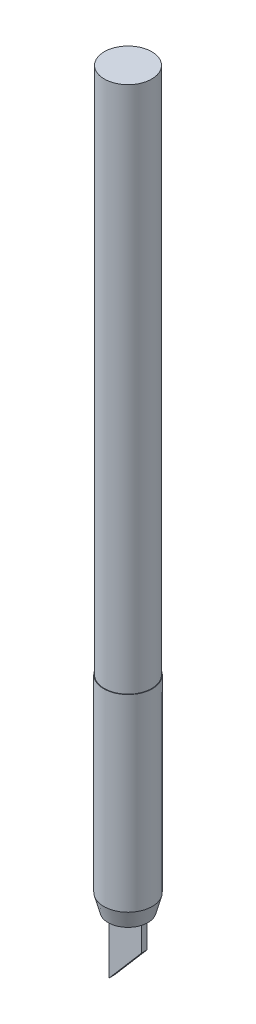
from build123d import *

# Parameters (mm, degrees)
SKETCH1_R                = 4.4
BOSS_EXTRUDE1_DEPTH      = 98
SKETCH2_R                = 4.5
BOSS_EXTRUDE2_DEPTH      = 38
CHAMFER1_SIZE            = 3
CHAMFER1_SIZE2           = 0.803847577
BOSS_EXTRUDE3_DEPTH      = 0.5
BOSS_EXTRUDE3_DEPTH_BACK = 0.5


with BuildPart() as part:
    # Sketch1 → Boss-Extrude1 (new body)
    with BuildSketch(Plane(origin=(0, 0, 0), x_dir=(1, 0, 0), z_dir=(0, 1, 0))):
        with Locations(Location((0, 0, 0), (0, 0, 270))):
            Circle(SKETCH1_R)
    extrude(amount=BOSS_EXTRUDE1_DEPTH)

    # Sketch2 → Boss-Extrude2 (add)
    with BuildSketch(Plane.XZ):
        with Locations(Location((0, 0, 0), (0, 0, 270))):
            Circle(SKETCH2_R)
    extrude(amount=BOSS_EXTRUDE2_DEPTH)

    # Chamfer1
    chamfer1_edges = [part.edges().sort_by_distance(p)[0] for p in [
        (0, -38, 4.5),
    ]]
    chamfer1_side = [part.faces().sort_by_distance(p)[0] for p in [
        (0, -19, 4.5),
    ]]
    chamfer(chamfer1_edges, length=CHAMFER1_SIZE, length2=CHAMFER1_SIZE2, reference=chamfer1_side[0])

    # Sketch3 → Boss-Extrude3 (add, two sides: drawn at the far end of the back side and taken through both)
    with BuildSketch(Plane.XY.offset(-BOSS_EXTRUDE3_DEPTH_BACK)):
        Polygon((-3, -38), (-3, -50), (3, -43), (3, -38), align=None)
    extrude(amount=BOSS_EXTRUDE3_DEPTH + BOSS_EXTRUDE3_DEPTH_BACK)


solid = part.part
